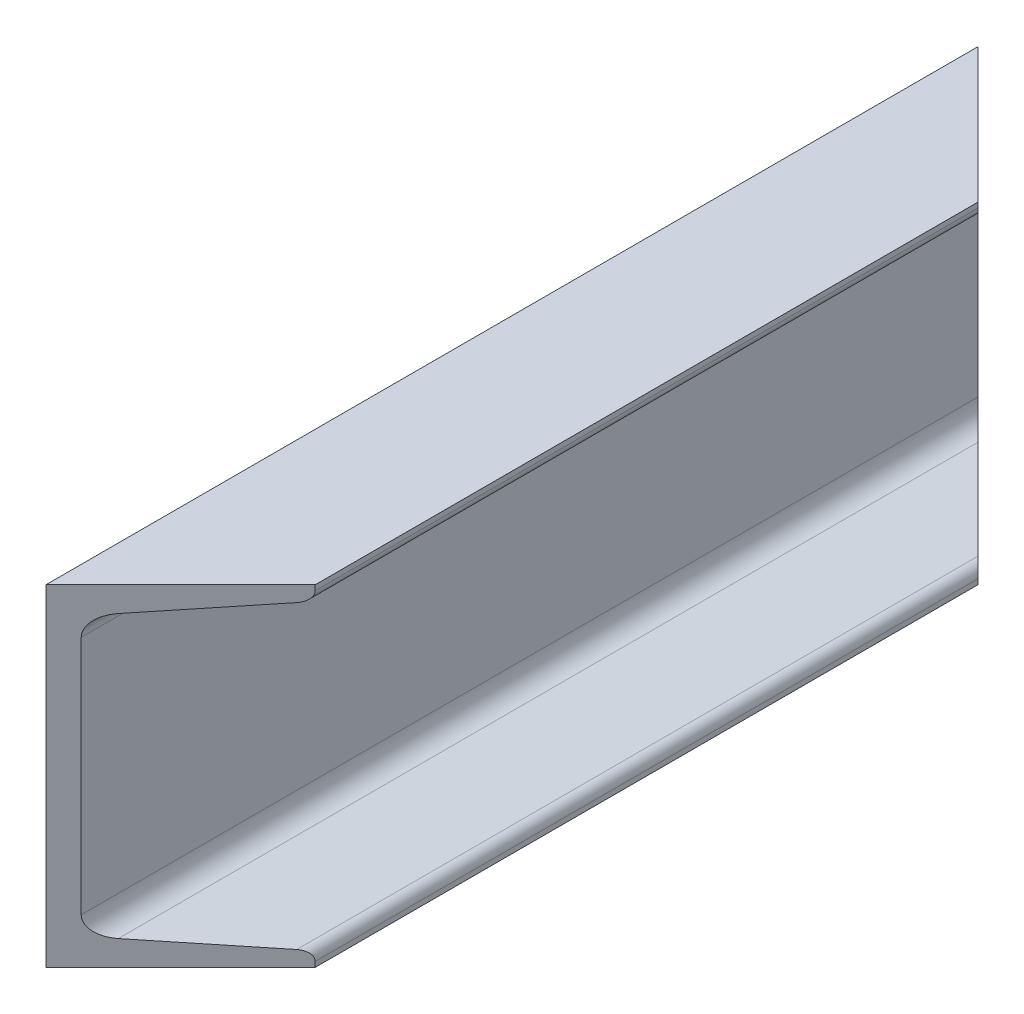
ISO-10303-21;
HEADER;
FILE_DESCRIPTION(('STEP AP214'),'2;1');
FILE_NAME('part.step','',(''),(''),'','','');
FILE_SCHEMA(('AUTOMOTIVE_DESIGN { 1 0 10303 214 1 1 1 1 }'));
ENDSEC;
DATA;
#1=APPLICATION_CONTEXT('core data for automotive mechanical design processes');
#2=APPLICATION_PROTOCOL_DEFINITION('international standard','automotive_design',2000,#1);
#3=PRODUCT_CONTEXT('',#1,'mechanical');
#4=PRODUCT('Part','Part','',(#3));
#5=PRODUCT_RELATED_PRODUCT_CATEGORY('part','',(#4));
#6=PRODUCT_DEFINITION_FORMATION('','',#4);
#7=PRODUCT_DEFINITION_CONTEXT('part definition',#1,'design');
#8=PRODUCT_DEFINITION('design','',#6,#7);
#9=PRODUCT_DEFINITION_SHAPE('','',#8);
#10=(LENGTH_UNIT() NAMED_UNIT(*) SI_UNIT(.MILLI.,.METRE.));
#11=(NAMED_UNIT(*) PLANE_ANGLE_UNIT() SI_UNIT($,.RADIAN.));
#12=(NAMED_UNIT(*) SI_UNIT($,.STERADIAN.) SOLID_ANGLE_UNIT());
#13=UNCERTAINTY_MEASURE_WITH_UNIT(LENGTH_MEASURE(1.E-05),#10,'distance_accuracy_value','');
#14=(GEOMETRIC_REPRESENTATION_CONTEXT(3) GLOBAL_UNCERTAINTY_ASSIGNED_CONTEXT((#13)) GLOBAL_UNIT_ASSIGNED_CONTEXT((#10,
#11,#12)) REPRESENTATION_CONTEXT('',''));
#15=CARTESIAN_POINT('',(0.,0.,0.));
#16=DIRECTION('',(0.,0.,1.));
#17=DIRECTION('',(1.,0.,0.));
#18=AXIS2_PLACEMENT_3D('',#15,#16,#17);
#19=CARTESIAN_POINT('',(65.0000000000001,80.,225.));
#20=DIRECTION('',(0.,-1.,0.));
#21=DIRECTION('',(1.,0.,0.));
#22=AXIS2_PLACEMENT_3D('',#19,#20,#21);
#23=PLANE('',#22);
#24=DIRECTION('',(0.,0.,-1.));
#25=VECTOR('',#24,1.);
#26=CARTESIAN_POINT('',(65.0000000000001,80.,225.));
#27=LINE('',#26,#25);
#28=CARTESIAN_POINT('',(65.0000000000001,80.,159.999999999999));
#29=VERTEX_POINT('',#28);
#30=CARTESIAN_POINT('',(65.0000000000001,80.,-159.999999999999));
#31=VERTEX_POINT('',#30);
#32=EDGE_CURVE('E141',#29,#31,#27,.T.);
#33=ORIENTED_EDGE('',*,*,#32,.T.);
#34=DIRECTION('',(0.707106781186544,0.,0.707106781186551));
#35=VECTOR('',#34,1.);
#36=CARTESIAN_POINT('',(65.0000000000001,80.,-159.999999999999));
#37=LINE('',#36,#35);
#38=CARTESIAN_POINT('',(0.,80.,-225.));
#39=VERTEX_POINT('',#38);
#40=EDGE_CURVE('E129',#39,#31,#37,.T.);
#41=ORIENTED_EDGE('',*,*,#40,.F.);
#42=DIRECTION('',(0.,0.,-1.));
#43=VECTOR('',#42,1.);
#44=CARTESIAN_POINT('',(0.,80.,225.));
#45=LINE('',#44,#43);
#46=CARTESIAN_POINT('',(0.,80.,225.));
#47=VERTEX_POINT('',#46);
#48=EDGE_CURVE('E11',#47,#39,#45,.T.);
#49=ORIENTED_EDGE('',*,*,#48,.F.);
#50=DIRECTION('',(-0.707106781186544,0.,0.707106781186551));
#51=VECTOR('',#50,1.);
#52=CARTESIAN_POINT('',(65.0000000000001,80.,159.999999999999));
#53=LINE('',#52,#51);
#54=EDGE_CURVE('E55',#29,#47,#53,.T.);
#55=ORIENTED_EDGE('',*,*,#54,.F.);
#56=EDGE_LOOP('',(#33,#41,#49,#55));
#57=FACE_BOUND('',#56,.T.);
#58=ADVANCED_FACE('F41',(#57),#23,.F.);
#59=CARTESIAN_POINT('',(0.,80.,225.));
#60=DIRECTION('',(1.,0.,0.));
#61=DIRECTION('',(0.,0.,-1.));
#62=AXIS2_PLACEMENT_3D('',#59,#60,#61);
#63=PLANE('',#62);
#64=DIRECTION('',(0.,-1.,0.));
#65=VECTOR('',#64,1.);
#66=CARTESIAN_POINT('',(0.,80.,-225.));
#67=LINE('',#66,#65);
#68=CARTESIAN_POINT('',(0.,-80.,-225.));
#69=VERTEX_POINT('',#68);
#70=EDGE_CURVE('E126',#39,#69,#67,.T.);
#71=ORIENTED_EDGE('',*,*,#70,.T.);
#72=DIRECTION('',(0.,0.,-1.));
#73=VECTOR('',#72,1.);
#74=CARTESIAN_POINT('',(0.,-80.,225.));
#75=LINE('',#74,#73);
#76=CARTESIAN_POINT('',(0.,-80.,225.));
#77=VERTEX_POINT('',#76);
#78=EDGE_CURVE('E48',#77,#69,#75,.T.);
#79=ORIENTED_EDGE('',*,*,#78,.F.);
#80=DIRECTION('',(0.,-1.,0.));
#81=VECTOR('',#80,1.);
#82=CARTESIAN_POINT('',(0.,80.,225.));
#83=LINE('',#82,#81);
#84=EDGE_CURVE('E134',#47,#77,#83,.T.);
#85=ORIENTED_EDGE('',*,*,#84,.F.);
#86=ORIENTED_EDGE('',*,*,#48,.T.);
#87=EDGE_LOOP('',(#71,#79,#85,#86));
#88=FACE_BOUND('',#87,.T.);
#89=ADVANCED_FACE('F144',(#88),#63,.F.);
#90=CARTESIAN_POINT('',(0.,-80.,225.));
#91=DIRECTION('',(0.,1.,0.));
#92=DIRECTION('',(0.,0.,1.));
#93=AXIS2_PLACEMENT_3D('',#90,#91,#92);
#94=PLANE('',#93);
#95=ORIENTED_EDGE('',*,*,#78,.T.);
#96=DIRECTION('',(0.707106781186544,0.,0.707106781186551));
#97=VECTOR('',#96,1.);
#98=CARTESIAN_POINT('',(225.,-80.,2.22044604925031E-12));
#99=LINE('',#98,#97);
#100=CARTESIAN_POINT('',(65.,-80.,-159.999999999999));
#101=VERTEX_POINT('',#100);
#102=EDGE_CURVE('E63',#69,#101,#99,.T.);
#103=ORIENTED_EDGE('',*,*,#102,.T.);
#104=DIRECTION('',(0.,0.,-1.));
#105=VECTOR('',#104,1.);
#106=CARTESIAN_POINT('',(65.,-80.,225.));
#107=LINE('',#106,#105);
#108=CARTESIAN_POINT('',(65.,-80.,159.999999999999));
#109=VERTEX_POINT('',#108);
#110=EDGE_CURVE('E174',#109,#101,#107,.T.);
#111=ORIENTED_EDGE('',*,*,#110,.F.);
#112=DIRECTION('',(-0.707106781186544,0.,0.707106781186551));
#113=VECTOR('',#112,1.);
#114=CARTESIAN_POINT('',(0.,-80.,225.));
#115=LINE('',#114,#113);
#116=EDGE_CURVE('E135',#109,#77,#115,.T.);
#117=ORIENTED_EDGE('',*,*,#116,.T.);
#118=EDGE_LOOP('',(#95,#103,#111,#117));
#119=FACE_BOUND('',#118,.T.);
#120=ADVANCED_FACE('F177',(#119),#94,.F.);
#121=CARTESIAN_POINT('',(65.,-80.,225.));
#122=DIRECTION('',(-1.,0.,0.));
#123=DIRECTION('',(0.,0.,1.));
#124=AXIS2_PLACEMENT_3D('',#121,#122,#123);
#125=PLANE('',#124);
#126=ORIENTED_EDGE('',*,*,#110,.T.);
#127=DIRECTION('',(0.,1.,0.));
#128=VECTOR('',#127,1.);
#129=CARTESIAN_POINT('',(65.0000000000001,-420.,-159.999999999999));
#130=LINE('',#129,#128);
#131=CARTESIAN_POINT('',(65.,-77.4971407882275,-159.999999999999));
#132=VERTEX_POINT('',#131);
#133=EDGE_CURVE('E228',#101,#132,#130,.T.);
#134=ORIENTED_EDGE('',*,*,#133,.T.);
#135=DIRECTION('',(0.,0.,-1.));
#136=VECTOR('',#135,1.);
#137=CARTESIAN_POINT('',(65.,-77.4971407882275,225.));
#138=LINE('',#137,#136);
#139=CARTESIAN_POINT('',(65.,-77.4971407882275,159.999999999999));
#140=VERTEX_POINT('',#139);
#141=EDGE_CURVE('E171',#140,#132,#138,.T.);
#142=ORIENTED_EDGE('',*,*,#141,.F.);
#143=DIRECTION('',(0.,1.,0.));
#144=VECTOR('',#143,1.);
#145=CARTESIAN_POINT('',(65.0000000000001,-420.,159.999999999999));
#146=LINE('',#145,#144);
#147=EDGE_CURVE('E202',#109,#140,#146,.T.);
#148=ORIENTED_EDGE('',*,*,#147,.F.);
#149=EDGE_LOOP('',(#126,#134,#142,#148));
#150=FACE_BOUND('',#149,.T.);
#151=ADVANCED_FACE('F233',(#150),#125,.F.);
#152=CARTESIAN_POINT('',(60.,-77.4971407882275,225.));
#153=DIRECTION('',(0.,0.,-1.));
#154=DIRECTION('',(-1.,0.,0.));
#155=AXIS2_PLACEMENT_3D('',#152,#153,#154);
#156=CYLINDRICAL_SURFACE('',#155,5.);
#157=ORIENTED_EDGE('',*,*,#141,.T.);
#158=CARTESIAN_POINT('',(60.,-77.4971407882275,-164.999999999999));
#159=DIRECTION('',(-0.707106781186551,0.,0.707106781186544));
#160=DIRECTION('',(-0.707106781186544,0.,-0.707106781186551));
#161=AXIS2_PLACEMENT_3D('',#158,#159,#160);
#162=ELLIPSE('',#161,7.07106781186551,5.);
#163=CARTESIAN_POINT('',(60.5280045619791,-72.5250978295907,-164.47199543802));
#164=VERTEX_POINT('',#163);
#165=EDGE_CURVE('E207',#132,#164,#162,.T.);
#166=ORIENTED_EDGE('',*,*,#165,.T.);
#167=DIRECTION('',(0.,0.,-1.));
#168=VECTOR('',#167,1.);
#169=CARTESIAN_POINT('',(60.5280045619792,-72.5250978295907,225.));
#170=LINE('',#169,#168);
#171=CARTESIAN_POINT('',(60.5280045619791,-72.5250978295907,164.47199543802));
#172=VERTEX_POINT('',#171);
#173=EDGE_CURVE('E168',#172,#164,#170,.T.);
#174=ORIENTED_EDGE('',*,*,#173,.F.);
#175=CARTESIAN_POINT('',(60.,-77.4971407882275,164.999999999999));
#176=DIRECTION('',(-0.707106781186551,0.,-0.707106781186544));
#177=DIRECTION('',(0.707106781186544,0.,-0.707106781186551));
#178=AXIS2_PLACEMENT_3D('',#175,#176,#177);
#179=ELLIPSE('',#178,7.07106781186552,5.);
#180=EDGE_CURVE('E180',#172,#140,#179,.T.);
#181=ORIENTED_EDGE('',*,*,#180,.T.);
#182=EDGE_LOOP('',(#157,#166,#174,#181));
#183=FACE_BOUND('',#182,.T.);
#184=ADVANCED_FACE('F235',(#183),#156,.T.);
#185=CARTESIAN_POINT('',(60.5280045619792,-72.5250978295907,225.));
#186=DIRECTION('',(-0.105600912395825,-0.994408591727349,0.));
#187=DIRECTION('',(0.994408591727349,-0.105600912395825,0.));
#188=AXIS2_PLACEMENT_3D('',#185,#186,#187);
#189=PLANE('',#188);
#190=ORIENTED_EDGE('',*,*,#173,.T.);
#191=DIRECTION('',(-0.705121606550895,0.0748801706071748,-0.705121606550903));
#192=VECTOR('',#191,1.);
#193=CARTESIAN_POINT('',(254.172109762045,-93.089073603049,29.1721097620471));
#194=LINE('',#193,#192);
#195=CARTESIAN_POINT('',(17.4439908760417,-67.9498043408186,-207.556009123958));
#196=VERTEX_POINT('',#195);
#197=EDGE_CURVE('E210',#164,#196,#194,.T.);
#198=ORIENTED_EDGE('',*,*,#197,.T.);
#199=DIRECTION('',(0.,0.,-1.));
#200=VECTOR('',#199,1.);
#201=CARTESIAN_POINT('',(17.4439908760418,-67.9498043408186,225.));
#202=LINE('',#201,#200);
#203=CARTESIAN_POINT('',(17.4439908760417,-67.9498043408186,207.556009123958));
#204=VERTEX_POINT('',#203);
#205=EDGE_CURVE('E165',#204,#196,#202,.T.);
#206=ORIENTED_EDGE('',*,*,#205,.F.);
#207=DIRECTION('',(0.705121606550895,-0.0748801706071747,-0.705121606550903));
#208=VECTOR('',#207,1.);
#209=CARTESIAN_POINT('',(30.4336937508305,-69.3292418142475,194.566306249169));
#210=LINE('',#209,#208);
#211=EDGE_CURVE('E182',#204,#172,#210,.T.);
#212=ORIENTED_EDGE('',*,*,#211,.T.);
#213=EDGE_LOOP('',(#190,#198,#206,#212));
#214=FACE_BOUND('',#213,.T.);
#215=ADVANCED_FACE('F240',(#214),#189,.F.);
#216=CARTESIAN_POINT('',(18.5,-58.0057184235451,225.));
#217=DIRECTION('',(0.,0.,-1.));
#218=DIRECTION('',(-1.,0.,0.));
#219=AXIS2_PLACEMENT_3D('',#216,#217,#218);
#220=CYLINDRICAL_SURFACE('',#219,9.99999999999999);
#221=ORIENTED_EDGE('',*,*,#205,.T.);
#222=CARTESIAN_POINT('',(18.5,-58.0057184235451,-206.5));
#223=DIRECTION('',(-0.707106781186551,0.,0.707106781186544));
#224=DIRECTION('',(-0.707106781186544,0.,-0.707106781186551));
#225=AXIS2_PLACEMENT_3D('',#222,#223,#224);
#226=ELLIPSE('',#225,14.142135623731,9.99999999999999);
#227=CARTESIAN_POINT('',(8.49999999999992,-58.0057184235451,-216.5));
#228=VERTEX_POINT('',#227);
#229=EDGE_CURVE('E213',#196,#228,#226,.F.);
#230=ORIENTED_EDGE('',*,*,#229,.T.);
#231=DIRECTION('',(0.,0.,-1.));
#232=VECTOR('',#231,1.);
#233=CARTESIAN_POINT('',(8.50000000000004,-58.0057184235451,225.));
#234=LINE('',#233,#232);
#235=CARTESIAN_POINT('',(8.50000000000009,-58.0057184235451,216.5));
#236=VERTEX_POINT('',#235);
#237=EDGE_CURVE('E162',#236,#228,#234,.T.);
#238=ORIENTED_EDGE('',*,*,#237,.F.);
#239=CARTESIAN_POINT('',(18.4999999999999,-58.0057184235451,206.5));
#240=DIRECTION('',(-0.707106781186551,0.,-0.707106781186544));
#241=DIRECTION('',(0.707106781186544,0.,-0.707106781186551));
#242=AXIS2_PLACEMENT_3D('',#239,#240,#241);
#243=ELLIPSE('',#242,14.142135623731,9.99999999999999);
#244=EDGE_CURVE('E187',#236,#204,#243,.F.);
#245=ORIENTED_EDGE('',*,*,#244,.T.);
#246=EDGE_LOOP('',(#221,#230,#238,#245));
#247=FACE_BOUND('',#246,.T.);
#248=ADVANCED_FACE('F242',(#247),#220,.F.);
#249=CARTESIAN_POINT('',(8.50000000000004,-58.0057184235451,225.));
#250=DIRECTION('',(-1.,0.,0.));
#251=DIRECTION('',(0.,0.,1.));
#252=AXIS2_PLACEMENT_3D('',#249,#250,#251);
#253=PLANE('',#252);
#254=ORIENTED_EDGE('',*,*,#237,.T.);
#255=DIRECTION('',(0.,1.,0.));
#256=VECTOR('',#255,1.);
#257=CARTESIAN_POINT('',(8.49999999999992,-58.005718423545,-216.5));
#258=LINE('',#257,#256);
#259=CARTESIAN_POINT('',(8.50000000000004,58.0057184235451,-216.5));
#260=VERTEX_POINT('',#259);
#261=EDGE_CURVE('E216',#228,#260,#258,.T.);
#262=ORIENTED_EDGE('',*,*,#261,.T.);
#263=DIRECTION('',(0.,0.,-1.));
#264=VECTOR('',#263,1.);
#265=CARTESIAN_POINT('',(8.50000000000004,58.0057184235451,225.));
#266=LINE('',#265,#264);
#267=CARTESIAN_POINT('',(8.50000000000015,58.0057184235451,216.5));
#268=VERTEX_POINT('',#267);
#269=EDGE_CURVE('E159',#268,#260,#266,.T.);
#270=ORIENTED_EDGE('',*,*,#269,.F.);
#271=DIRECTION('',(0.,-1.,0.));
#272=VECTOR('',#271,1.);
#273=CARTESIAN_POINT('',(8.50000000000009,-58.0057184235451,216.5));
#274=LINE('',#273,#272);
#275=EDGE_CURVE('E190',#268,#236,#274,.T.);
#276=ORIENTED_EDGE('',*,*,#275,.T.);
#277=EDGE_LOOP('',(#254,#262,#270,#276));
#278=FACE_BOUND('',#277,.T.);
#279=ADVANCED_FACE('F246',(#278),#253,.F.);
#280=CARTESIAN_POINT('',(18.5,58.0057184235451,225.));
#281=DIRECTION('',(0.,0.,-1.));
#282=DIRECTION('',(-1.,0.,0.));
#283=AXIS2_PLACEMENT_3D('',#280,#281,#282);
#284=CYLINDRICAL_SURFACE('',#283,10.);
#285=ORIENTED_EDGE('',*,*,#269,.T.);
#286=CARTESIAN_POINT('',(18.5,58.0057184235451,-206.5));
#287=DIRECTION('',(-0.707106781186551,0.,0.707106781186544));
#288=DIRECTION('',(-0.707106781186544,0.,-0.707106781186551));
#289=AXIS2_PLACEMENT_3D('',#286,#287,#288);
#290=ELLIPSE('',#289,14.142135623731,10.);
#291=CARTESIAN_POINT('',(17.4439908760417,67.9498043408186,-207.556009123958));
#292=VERTEX_POINT('',#291);
#293=EDGE_CURVE('E219',#260,#292,#290,.F.);
#294=ORIENTED_EDGE('',*,*,#293,.T.);
#295=DIRECTION('',(0.,0.,-1.));
#296=VECTOR('',#295,1.);
#297=CARTESIAN_POINT('',(17.4439908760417,67.9498043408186,225.));
#298=LINE('',#297,#296);
#299=CARTESIAN_POINT('',(17.4439908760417,67.9498043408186,207.556009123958));
#300=VERTEX_POINT('',#299);
#301=EDGE_CURVE('E156',#300,#292,#298,.T.);
#302=ORIENTED_EDGE('',*,*,#301,.F.);
#303=CARTESIAN_POINT('',(18.5,58.0057184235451,206.5));
#304=DIRECTION('',(-0.707106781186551,0.,-0.707106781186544));
#305=DIRECTION('',(0.707106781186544,0.,-0.707106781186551));
#306=AXIS2_PLACEMENT_3D('',#303,#304,#305);
#307=ELLIPSE('',#306,14.142135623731,10.);
#308=EDGE_CURVE('E193',#300,#268,#307,.F.);
#309=ORIENTED_EDGE('',*,*,#308,.T.);
#310=EDGE_LOOP('',(#285,#294,#302,#309));
#311=FACE_BOUND('',#310,.T.);
#312=ADVANCED_FACE('F248',(#311),#284,.F.);
#313=CARTESIAN_POINT('',(17.4439908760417,67.9498043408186,225.));
#314=DIRECTION('',(-0.105600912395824,0.994408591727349,0.));
#315=DIRECTION('',(-0.99440859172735,-0.105600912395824,0.));
#316=AXIS2_PLACEMENT_3D('',#313,#314,#315);
#317=PLANE('',#316);
#318=ORIENTED_EDGE('',*,*,#301,.T.);
#319=DIRECTION('',(0.705121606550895,0.0748801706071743,0.705121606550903));
#320=VECTOR('',#319,1.);
#321=CARTESIAN_POINT('',(232.509316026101,90.7885999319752,7.50931602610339));
#322=LINE('',#321,#320);
#323=CARTESIAN_POINT('',(60.5280045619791,72.5250978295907,-164.47199543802));
#324=VERTEX_POINT('',#323);
#325=EDGE_CURVE('E222',#292,#324,#322,.T.);
#326=ORIENTED_EDGE('',*,*,#325,.T.);
#327=DIRECTION('',(0.,0.,-1.));
#328=VECTOR('',#327,1.);
#329=CARTESIAN_POINT('',(60.5280045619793,72.5250978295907,225.));
#330=LINE('',#329,#328);
#331=CARTESIAN_POINT('',(60.5280045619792,72.5250978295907,164.47199543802));
#332=VERTEX_POINT('',#331);
#333=EDGE_CURVE('E153',#332,#324,#330,.T.);
#334=ORIENTED_EDGE('',*,*,#333,.F.);
#335=DIRECTION('',(-0.705121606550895,-0.0748801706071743,0.705121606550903));
#336=VECTOR('',#335,1.);
#337=CARTESIAN_POINT('',(8.77090001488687,67.0287681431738,216.229099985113));
#338=LINE('',#337,#336);
#339=EDGE_CURVE('E196',#332,#300,#338,.T.);
#340=ORIENTED_EDGE('',*,*,#339,.T.);
#341=EDGE_LOOP('',(#318,#326,#334,#340));
#342=FACE_BOUND('',#341,.T.);
#343=ADVANCED_FACE('F252',(#342),#317,.F.);
#344=CARTESIAN_POINT('',(60.,77.4971407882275,225.));
#345=DIRECTION('',(0.,0.,-1.));
#346=DIRECTION('',(-1.,0.,0.));
#347=AXIS2_PLACEMENT_3D('',#344,#345,#346);
#348=CYLINDRICAL_SURFACE('',#347,5.);
#349=ORIENTED_EDGE('',*,*,#333,.T.);
#350=CARTESIAN_POINT('',(60.,77.4971407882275,-164.999999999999));
#351=DIRECTION('',(-0.707106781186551,0.,0.707106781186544));
#352=DIRECTION('',(-0.707106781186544,0.,-0.707106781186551));
#353=AXIS2_PLACEMENT_3D('',#350,#351,#352);
#354=ELLIPSE('',#353,7.07106781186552,5.);
#355=CARTESIAN_POINT('',(65.,77.4971407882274,-159.999999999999));
#356=VERTEX_POINT('',#355);
#357=EDGE_CURVE('E225',#324,#356,#354,.T.);
#358=ORIENTED_EDGE('',*,*,#357,.T.);
#359=DIRECTION('',(0.,0.,-1.));
#360=VECTOR('',#359,1.);
#361=CARTESIAN_POINT('',(65.0000000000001,77.4971407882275,225.));
#362=LINE('',#361,#360);
#363=CARTESIAN_POINT('',(65.0000000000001,77.4971407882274,159.999999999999));
#364=VERTEX_POINT('',#363);
#365=EDGE_CURVE('E147',#364,#356,#362,.T.);
#366=ORIENTED_EDGE('',*,*,#365,.F.);
#367=CARTESIAN_POINT('',(60.,77.4971407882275,164.999999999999));
#368=DIRECTION('',(-0.707106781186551,0.,-0.707106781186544));
#369=DIRECTION('',(0.707106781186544,0.,-0.707106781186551));
#370=AXIS2_PLACEMENT_3D('',#367,#368,#369);
#371=ELLIPSE('',#370,7.07106781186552,5.);
#372=EDGE_CURVE('E199',#364,#332,#371,.T.);
#373=ORIENTED_EDGE('',*,*,#372,.T.);
#374=EDGE_LOOP('',(#349,#358,#366,#373));
#375=FACE_BOUND('',#374,.T.);
#376=ADVANCED_FACE('F254',(#375),#348,.T.);
#377=CARTESIAN_POINT('',(65.0000000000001,77.4971407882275,225.));
#378=DIRECTION('',(-1.,0.,0.));
#379=DIRECTION('',(0.,0.,1.));
#380=AXIS2_PLACEMENT_3D('',#377,#378,#379);
#381=PLANE('',#380);
#382=ORIENTED_EDGE('',*,*,#365,.T.);
#383=EDGE_CURVE('E142',#356,#31,#130,.T.);
#384=ORIENTED_EDGE('',*,*,#383,.T.);
#385=ORIENTED_EDGE('',*,*,#32,.F.);
#386=EDGE_CURVE('E203',#364,#29,#146,.T.);
#387=ORIENTED_EDGE('',*,*,#386,.F.);
#388=EDGE_LOOP('',(#382,#384,#385,#387));
#389=FACE_BOUND('',#388,.T.);
#390=ADVANCED_FACE('F257',(#389),#381,.F.);
#391=CARTESIAN_POINT('',(65.0000000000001,-420.,159.999999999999));
#392=DIRECTION('',(-0.707106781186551,0.,-0.707106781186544));
#393=DIRECTION('',(-0.707106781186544,0.,0.707106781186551));
#394=AXIS2_PLACEMENT_3D('',#391,#392,#393);
#395=PLANE('',#394);
#396=ORIENTED_EDGE('',*,*,#147,.T.);
#397=ORIENTED_EDGE('',*,*,#180,.F.);
#398=ORIENTED_EDGE('',*,*,#211,.F.);
#399=ORIENTED_EDGE('',*,*,#244,.F.);
#400=ORIENTED_EDGE('',*,*,#275,.F.);
#401=ORIENTED_EDGE('',*,*,#308,.F.);
#402=ORIENTED_EDGE('',*,*,#339,.F.);
#403=ORIENTED_EDGE('',*,*,#372,.F.);
#404=ORIENTED_EDGE('',*,*,#386,.T.);
#405=ORIENTED_EDGE('',*,*,#54,.T.);
#406=ORIENTED_EDGE('',*,*,#84,.T.);
#407=ORIENTED_EDGE('',*,*,#116,.F.);
#408=EDGE_LOOP('',(#396,#397,#398,#399,#400,#401,#402,#403,#404,#405,#406,#407));
#409=FACE_BOUND('',#408,.T.);
#410=ADVANCED_FACE('F237',(#409),#395,.F.);
#411=CARTESIAN_POINT('',(65.0000000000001,-420.,-159.999999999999));
#412=DIRECTION('',(-0.707106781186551,0.,0.707106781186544));
#413=DIRECTION('',(0.707106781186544,0.,0.707106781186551));
#414=AXIS2_PLACEMENT_3D('',#411,#412,#413);
#415=PLANE('',#414);
#416=ORIENTED_EDGE('',*,*,#70,.F.);
#417=ORIENTED_EDGE('',*,*,#40,.T.);
#418=ORIENTED_EDGE('',*,*,#383,.F.);
#419=ORIENTED_EDGE('',*,*,#357,.F.);
#420=ORIENTED_EDGE('',*,*,#325,.F.);
#421=ORIENTED_EDGE('',*,*,#293,.F.);
#422=ORIENTED_EDGE('',*,*,#261,.F.);
#423=ORIENTED_EDGE('',*,*,#229,.F.);
#424=ORIENTED_EDGE('',*,*,#197,.F.);
#425=ORIENTED_EDGE('',*,*,#165,.F.);
#426=ORIENTED_EDGE('',*,*,#133,.F.);
#427=ORIENTED_EDGE('',*,*,#102,.F.);
#428=EDGE_LOOP('',(#416,#417,#418,#419,#420,#421,#422,#423,#424,#425,#426,#427));
#429=FACE_BOUND('',#428,.T.);
#430=ADVANCED_FACE('F128',(#429),#415,.F.);
#431=CLOSED_SHELL('',(#58,#89,#120,#151,#184,#215,#248,#279,#312,#343,#376,#390,#410,#430));
#432=MANIFOLD_SOLID_BREP('B2',#431);
#433=ADVANCED_BREP_SHAPE_REPRESENTATION('',(#18,#432),#14);
#434=SHAPE_DEFINITION_REPRESENTATION(#9,#433);
ENDSEC;
END-ISO-10303-21;
